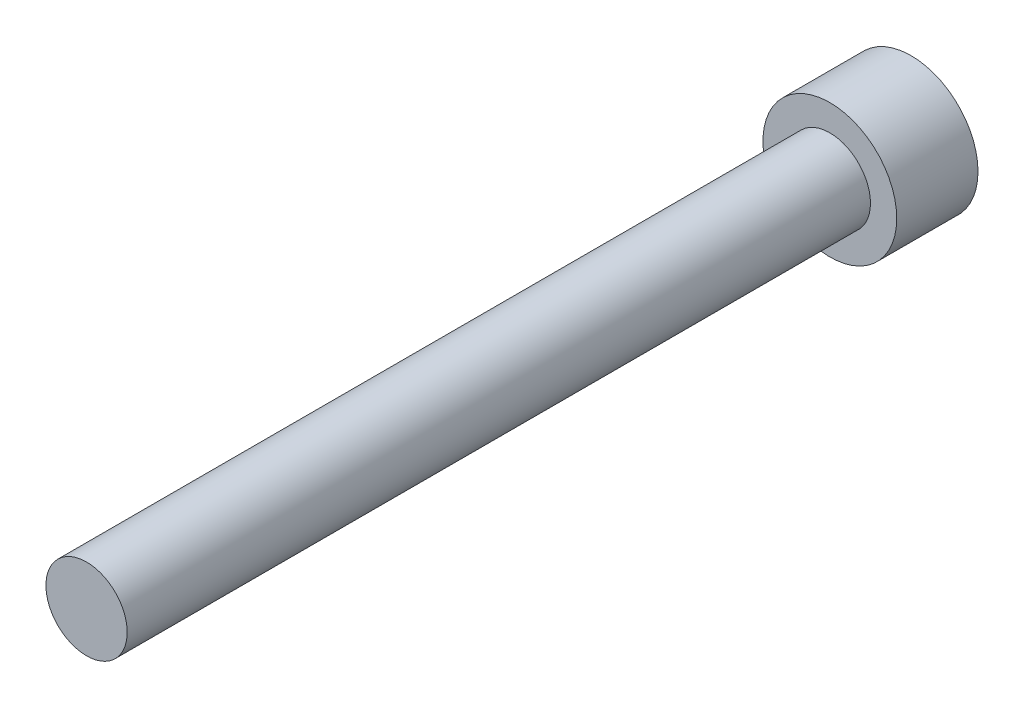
ISO-10303-21;
HEADER;
FILE_DESCRIPTION(('STEP AP214'),'2;1');
FILE_NAME('part.step','',(''),(''),'','','');
FILE_SCHEMA(('AUTOMOTIVE_DESIGN { 1 0 10303 214 1 1 1 1 }'));
ENDSEC;
DATA;
#1=APPLICATION_CONTEXT('core data for automotive mechanical design processes');
#2=APPLICATION_PROTOCOL_DEFINITION('international standard','automotive_design',2000,#1);
#3=PRODUCT_CONTEXT('',#1,'mechanical');
#4=PRODUCT('Part','Part','',(#3));
#5=PRODUCT_RELATED_PRODUCT_CATEGORY('part','',(#4));
#6=PRODUCT_DEFINITION_FORMATION('','',#4);
#7=PRODUCT_DEFINITION_CONTEXT('part definition',#1,'design');
#8=PRODUCT_DEFINITION('design','',#6,#7);
#9=PRODUCT_DEFINITION_SHAPE('','',#8);
#10=(LENGTH_UNIT() NAMED_UNIT(*) SI_UNIT(.MILLI.,.METRE.));
#11=(NAMED_UNIT(*) PLANE_ANGLE_UNIT() SI_UNIT($,.RADIAN.));
#12=(NAMED_UNIT(*) SI_UNIT($,.STERADIAN.) SOLID_ANGLE_UNIT());
#13=UNCERTAINTY_MEASURE_WITH_UNIT(LENGTH_MEASURE(1.E-05),#10,'distance_accuracy_value','');
#14=(GEOMETRIC_REPRESENTATION_CONTEXT(3) GLOBAL_UNCERTAINTY_ASSIGNED_CONTEXT((#13)) GLOBAL_UNIT_ASSIGNED_CONTEXT((#10,
#11,#12)) REPRESENTATION_CONTEXT('',''));
#15=CARTESIAN_POINT('',(0.,0.,0.));
#16=DIRECTION('',(0.,0.,1.));
#17=DIRECTION('',(1.,0.,0.));
#18=AXIS2_PLACEMENT_3D('',#15,#16,#17);
#19=CARTESIAN_POINT('',(0.,0.,38.1));
#20=DIRECTION('',(0.,0.,1.));
#21=DIRECTION('',(1.,0.,0.));
#22=AXIS2_PLACEMENT_3D('',#19,#20,#21);
#23=PLANE('',#22);
#24=CARTESIAN_POINT('',(0.,0.,38.1));
#25=DIRECTION('',(0.,0.,1.));
#26=DIRECTION('',(1.,0.,0.));
#27=AXIS2_PLACEMENT_3D('',#24,#25,#26);
#28=CIRCLE('',#27,2.0828);
#29=CARTESIAN_POINT('',(2.0828,0.,38.1));
#30=VERTEX_POINT('',#29);
#31=EDGE_CURVE('E11',#30,#30,#28,.T.);
#32=ORIENTED_EDGE('',*,*,#31,.T.);
#33=EDGE_LOOP('',(#32));
#34=FACE_BOUND('',#33,.T.);
#35=ADVANCED_FACE('F37',(#34),#23,.T.);
#36=CARTESIAN_POINT('',(0.,0.,38.1));
#37=DIRECTION('',(0.,0.,1.));
#38=DIRECTION('',(1.,0.,0.));
#39=AXIS2_PLACEMENT_3D('',#36,#37,#38);
#40=CYLINDRICAL_SURFACE('',#39,2.0828);
#41=CARTESIAN_POINT('',(0.,0.,0.));
#42=DIRECTION('',(0.,0.,1.));
#43=DIRECTION('',(1.,0.,0.));
#44=AXIS2_PLACEMENT_3D('',#41,#42,#43);
#45=CIRCLE('',#44,2.0828);
#46=CARTESIAN_POINT('',(2.0828,0.,0.));
#47=VERTEX_POINT('',#46);
#48=EDGE_CURVE('E44',#47,#47,#45,.T.);
#49=ORIENTED_EDGE('',*,*,#48,.T.);
#50=EDGE_LOOP('',(#49));
#51=FACE_BOUND('',#50,.T.);
#52=ORIENTED_EDGE('',*,*,#31,.F.);
#53=EDGE_LOOP('',(#52));
#54=FACE_BOUND('',#53,.T.);
#55=ADVANCED_FACE('F151',(#51,#54),#40,.T.);
#56=CARTESIAN_POINT('',(0.,-2.0828,0.));
#57=DIRECTION('',(0.,0.,1.));
#58=DIRECTION('',(1.,0.,0.));
#59=AXIS2_PLACEMENT_3D('',#56,#57,#58);
#60=PLANE('',#59);
#61=CARTESIAN_POINT('',(0.,0.,0.));
#62=DIRECTION('',(0.,0.,1.));
#63=DIRECTION('',(1.,0.,0.));
#64=AXIS2_PLACEMENT_3D('',#61,#62,#63);
#65=CIRCLE('',#64,3.429);
#66=CARTESIAN_POINT('',(3.429,0.,0.));
#67=VERTEX_POINT('',#66);
#68=EDGE_CURVE('E146',#67,#67,#65,.T.);
#69=ORIENTED_EDGE('',*,*,#68,.T.);
#70=EDGE_LOOP('',(#69));
#71=FACE_BOUND('',#70,.T.);
#72=ORIENTED_EDGE('',*,*,#48,.F.);
#73=EDGE_LOOP('',(#72));
#74=FACE_BOUND('',#73,.T.);
#75=ADVANCED_FACE('F154',(#71,#74),#60,.T.);
#76=CARTESIAN_POINT('',(0.,0.,38.1));
#77=DIRECTION('',(0.,0.,1.));
#78=DIRECTION('',(1.,0.,0.));
#79=AXIS2_PLACEMENT_3D('',#76,#77,#78);
#80=CYLINDRICAL_SURFACE('',#79,3.429);
#81=CARTESIAN_POINT('',(0.,0.,-4.1656));
#82=DIRECTION('',(0.,0.,1.));
#83=DIRECTION('',(1.,0.,0.));
#84=AXIS2_PLACEMENT_3D('',#81,#82,#83);
#85=CIRCLE('',#84,3.429);
#86=CARTESIAN_POINT('',(3.429,0.,-4.1656));
#87=VERTEX_POINT('',#86);
#88=EDGE_CURVE('E138',#87,#87,#85,.T.);
#89=ORIENTED_EDGE('',*,*,#88,.T.);
#90=EDGE_LOOP('',(#89));
#91=FACE_BOUND('',#90,.T.);
#92=ORIENTED_EDGE('',*,*,#68,.F.);
#93=EDGE_LOOP('',(#92));
#94=FACE_BOUND('',#93,.T.);
#95=ADVANCED_FACE('F156',(#91,#94),#80,.T.);
#96=CARTESIAN_POINT('',(0.,-3.429,-4.1656));
#97=DIRECTION('',(0.,0.,-1.));
#98=DIRECTION('',(-1.,0.,0.));
#99=AXIS2_PLACEMENT_3D('',#96,#97,#98);
#100=PLANE('',#99);
#101=DIRECTION('',(0.866025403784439,-0.5,0.));
#102=VECTOR('',#101,1.);
#103=CARTESIAN_POINT('',(0.,2.05305755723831,-4.1656));
#104=LINE('',#103,#102);
#105=CARTESIAN_POINT('',(0.,2.05305755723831,-4.1656));
#106=VERTEX_POINT('',#105);
#107=CARTESIAN_POINT('',(1.778,1.02652877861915,-4.1656));
#108=VERTEX_POINT('',#107);
#109=EDGE_CURVE('E51',#106,#108,#104,.T.);
#110=ORIENTED_EDGE('',*,*,#109,.F.);
#111=DIRECTION('',(0.866025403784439,0.5,0.));
#112=VECTOR('',#111,1.);
#113=CARTESIAN_POINT('',(-1.778,1.02652877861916,-4.1656));
#114=LINE('',#113,#112);
#115=CARTESIAN_POINT('',(-1.778,1.02652877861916,-4.1656));
#116=VERTEX_POINT('',#115);
#117=EDGE_CURVE('E134',#116,#106,#114,.T.);
#118=ORIENTED_EDGE('',*,*,#117,.F.);
#119=DIRECTION('',(0.,1.,0.));
#120=VECTOR('',#119,1.);
#121=CARTESIAN_POINT('',(-1.778,-1.02652877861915,-4.1656));
#122=LINE('',#121,#120);
#123=CARTESIAN_POINT('',(-1.778,-1.02652877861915,-4.1656));
#124=VERTEX_POINT('',#123);
#125=EDGE_CURVE('E132',#124,#116,#122,.T.);
#126=ORIENTED_EDGE('',*,*,#125,.F.);
#127=DIRECTION('',(-0.866025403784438,0.5,0.));
#128=VECTOR('',#127,1.);
#129=CARTESIAN_POINT('',(0.,-2.05305755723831,-4.1656));
#130=LINE('',#129,#128);
#131=CARTESIAN_POINT('',(0.,-2.05305755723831,-4.1656));
#132=VERTEX_POINT('',#131);
#133=EDGE_CURVE('E99',#132,#124,#130,.T.);
#134=ORIENTED_EDGE('',*,*,#133,.F.);
#135=DIRECTION('',(-0.866025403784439,-0.5,0.));
#136=VECTOR('',#135,1.);
#137=CARTESIAN_POINT('',(1.778,-1.02652877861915,-4.1656));
#138=LINE('',#137,#136);
#139=CARTESIAN_POINT('',(1.778,-1.02652877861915,-4.1656));
#140=VERTEX_POINT('',#139);
#141=EDGE_CURVE('E128',#140,#132,#138,.T.);
#142=ORIENTED_EDGE('',*,*,#141,.F.);
#143=DIRECTION('',(0.,-1.,0.));
#144=VECTOR('',#143,1.);
#145=CARTESIAN_POINT('',(1.778,1.02652877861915,-4.1656));
#146=LINE('',#145,#144);
#147=EDGE_CURVE('E125',#108,#140,#146,.T.);
#148=ORIENTED_EDGE('',*,*,#147,.F.);
#149=EDGE_LOOP('',(#110,#118,#126,#134,#142,#148));
#150=FACE_BOUND('',#149,.T.);
#151=ORIENTED_EDGE('',*,*,#88,.F.);
#152=EDGE_LOOP('',(#151));
#153=FACE_BOUND('',#152,.T.);
#154=ADVANCED_FACE('F163',(#150,#153),#100,.T.);
#155=CARTESIAN_POINT('',(0.,2.05305755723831,-1.3716));
#156=DIRECTION('',(0.5,0.866025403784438,0.));
#157=DIRECTION('',(-0.866025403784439,0.5,0.));
#158=AXIS2_PLACEMENT_3D('',#155,#156,#157);
#159=PLANE('',#158);
#160=ORIENTED_EDGE('',*,*,#109,.T.);
#161=DIRECTION('',(0.,0.,-1.));
#162=VECTOR('',#161,1.);
#163=CARTESIAN_POINT('',(1.778,1.02652877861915,-1.3716));
#164=LINE('',#163,#162);
#165=CARTESIAN_POINT('',(1.778,1.02652877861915,-1.3716));
#166=VERTEX_POINT('',#165);
#167=EDGE_CURVE('E81',#166,#108,#164,.T.);
#168=ORIENTED_EDGE('',*,*,#167,.F.);
#169=DIRECTION('',(0.866025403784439,-0.5,0.));
#170=VECTOR('',#169,1.);
#171=CARTESIAN_POINT('',(0.,2.05305755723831,-1.3716));
#172=LINE('',#171,#170);
#173=CARTESIAN_POINT('',(0.,2.05305755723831,-1.3716));
#174=VERTEX_POINT('',#173);
#175=EDGE_CURVE('E136',#174,#166,#172,.T.);
#176=ORIENTED_EDGE('',*,*,#175,.F.);
#177=DIRECTION('',(0.,0.,-1.));
#178=VECTOR('',#177,1.);
#179=CARTESIAN_POINT('',(0.,2.05305755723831,-1.3716));
#180=LINE('',#179,#178);
#181=EDGE_CURVE('E59',#174,#106,#180,.T.);
#182=ORIENTED_EDGE('',*,*,#181,.T.);
#183=EDGE_LOOP('',(#160,#168,#176,#182));
#184=FACE_BOUND('',#183,.T.);
#185=ADVANCED_FACE('F197',(#184),#159,.F.);
#186=CARTESIAN_POINT('',(-1.778,1.02652877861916,-1.3716));
#187=DIRECTION('',(-0.5,0.866025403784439,0.));
#188=DIRECTION('',(-0.866025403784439,-0.5,0.));
#189=AXIS2_PLACEMENT_3D('',#186,#187,#188);
#190=PLANE('',#189);
#191=ORIENTED_EDGE('',*,*,#117,.T.);
#192=ORIENTED_EDGE('',*,*,#181,.F.);
#193=DIRECTION('',(0.866025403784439,0.5,0.));
#194=VECTOR('',#193,1.);
#195=CARTESIAN_POINT('',(-1.778,1.02652877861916,-1.3716));
#196=LINE('',#195,#194);
#197=CARTESIAN_POINT('',(-1.778,1.02652877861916,-1.3716));
#198=VERTEX_POINT('',#197);
#199=EDGE_CURVE('E111',#198,#174,#196,.T.);
#200=ORIENTED_EDGE('',*,*,#199,.F.);
#201=DIRECTION('',(0.,0.,-1.));
#202=VECTOR('',#201,1.);
#203=CARTESIAN_POINT('',(-1.778,1.02652877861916,-1.3716));
#204=LINE('',#203,#202);
#205=EDGE_CURVE('E103',#198,#116,#204,.T.);
#206=ORIENTED_EDGE('',*,*,#205,.T.);
#207=EDGE_LOOP('',(#191,#192,#200,#206));
#208=FACE_BOUND('',#207,.T.);
#209=ADVANCED_FACE('F208',(#208),#190,.F.);
#210=CARTESIAN_POINT('',(-1.778,-1.02652877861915,-1.3716));
#211=DIRECTION('',(-1.,0.,0.));
#212=DIRECTION('',(0.,0.,1.));
#213=AXIS2_PLACEMENT_3D('',#210,#211,#212);
#214=PLANE('',#213);
#215=ORIENTED_EDGE('',*,*,#125,.T.);
#216=ORIENTED_EDGE('',*,*,#205,.F.);
#217=DIRECTION('',(0.,1.,0.));
#218=VECTOR('',#217,1.);
#219=CARTESIAN_POINT('',(-1.778,-1.02652877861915,-1.3716));
#220=LINE('',#219,#218);
#221=CARTESIAN_POINT('',(-1.778,-1.02652877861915,-1.3716));
#222=VERTEX_POINT('',#221);
#223=EDGE_CURVE('E107',#222,#198,#220,.T.);
#224=ORIENTED_EDGE('',*,*,#223,.F.);
#225=DIRECTION('',(0.,0.,-1.));
#226=VECTOR('',#225,1.);
#227=CARTESIAN_POINT('',(-1.778,-1.02652877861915,-1.3716));
#228=LINE('',#227,#226);
#229=EDGE_CURVE('E92',#222,#124,#228,.T.);
#230=ORIENTED_EDGE('',*,*,#229,.T.);
#231=EDGE_LOOP('',(#215,#216,#224,#230));
#232=FACE_BOUND('',#231,.T.);
#233=ADVANCED_FACE('F108',(#232),#214,.F.);
#234=CARTESIAN_POINT('',(0.,-2.05305755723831,-1.3716));
#235=DIRECTION('',(-0.5,-0.866025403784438,0.));
#236=DIRECTION('',(0.866025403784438,-0.5,0.));
#237=AXIS2_PLACEMENT_3D('',#234,#235,#236);
#238=PLANE('',#237);
#239=ORIENTED_EDGE('',*,*,#133,.T.);
#240=ORIENTED_EDGE('',*,*,#229,.F.);
#241=DIRECTION('',(-0.866025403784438,0.5,0.));
#242=VECTOR('',#241,1.);
#243=CARTESIAN_POINT('',(0.,-2.05305755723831,-1.3716));
#244=LINE('',#243,#242);
#245=CARTESIAN_POINT('',(0.,-2.05305755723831,-1.3716));
#246=VERTEX_POINT('',#245);
#247=EDGE_CURVE('E96',#246,#222,#244,.T.);
#248=ORIENTED_EDGE('',*,*,#247,.F.);
#249=DIRECTION('',(0.,0.,-1.));
#250=VECTOR('',#249,1.);
#251=CARTESIAN_POINT('',(0.,-2.05305755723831,-1.3716));
#252=LINE('',#251,#250);
#253=EDGE_CURVE('E104',#246,#132,#252,.T.);
#254=ORIENTED_EDGE('',*,*,#253,.T.);
#255=EDGE_LOOP('',(#239,#240,#248,#254));
#256=FACE_BOUND('',#255,.T.);
#257=ADVANCED_FACE('F94',(#256),#238,.F.);
#258=CARTESIAN_POINT('',(1.778,-1.02652877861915,-1.3716));
#259=DIRECTION('',(0.5,-0.866025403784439,0.));
#260=DIRECTION('',(0.866025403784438,0.5,0.));
#261=AXIS2_PLACEMENT_3D('',#258,#259,#260);
#262=PLANE('',#261);
#263=ORIENTED_EDGE('',*,*,#141,.T.);
#264=ORIENTED_EDGE('',*,*,#253,.F.);
#265=DIRECTION('',(-0.866025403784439,-0.5,0.));
#266=VECTOR('',#265,1.);
#267=CARTESIAN_POINT('',(1.778,-1.02652877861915,-1.3716));
#268=LINE('',#267,#266);
#269=CARTESIAN_POINT('',(1.778,-1.02652877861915,-1.3716));
#270=VERTEX_POINT('',#269);
#271=EDGE_CURVE('E117',#270,#246,#268,.T.);
#272=ORIENTED_EDGE('',*,*,#271,.F.);
#273=DIRECTION('',(0.,0.,-1.));
#274=VECTOR('',#273,1.);
#275=CARTESIAN_POINT('',(1.778,-1.02652877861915,-1.3716));
#276=LINE('',#275,#274);
#277=EDGE_CURVE('E141',#270,#140,#276,.T.);
#278=ORIENTED_EDGE('',*,*,#277,.T.);
#279=EDGE_LOOP('',(#263,#264,#272,#278));
#280=FACE_BOUND('',#279,.T.);
#281=ADVANCED_FACE('F236',(#280),#262,.F.);
#282=CARTESIAN_POINT('',(1.778,1.02652877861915,-1.3716));
#283=DIRECTION('',(1.,0.,0.));
#284=DIRECTION('',(0.,0.,-1.));
#285=AXIS2_PLACEMENT_3D('',#282,#283,#284);
#286=PLANE('',#285);
#287=ORIENTED_EDGE('',*,*,#147,.T.);
#288=ORIENTED_EDGE('',*,*,#277,.F.);
#289=DIRECTION('',(0.,-1.,0.));
#290=VECTOR('',#289,1.);
#291=CARTESIAN_POINT('',(1.778,1.02652877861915,-1.3716));
#292=LINE('',#291,#290);
#293=EDGE_CURVE('E119',#166,#270,#292,.T.);
#294=ORIENTED_EDGE('',*,*,#293,.F.);
#295=ORIENTED_EDGE('',*,*,#167,.T.);
#296=EDGE_LOOP('',(#287,#288,#294,#295));
#297=FACE_BOUND('',#296,.T.);
#298=ADVANCED_FACE('F246',(#297),#286,.F.);
#299=CARTESIAN_POINT('',(3.556,0.,-1.3716));
#300=DIRECTION('',(0.,0.,-1.));
#301=DIRECTION('',(-1.,0.,0.));
#302=AXIS2_PLACEMENT_3D('',#299,#300,#301);
#303=PLANE('',#302);
#304=ORIENTED_EDGE('',*,*,#175,.T.);
#305=ORIENTED_EDGE('',*,*,#293,.T.);
#306=ORIENTED_EDGE('',*,*,#271,.T.);
#307=ORIENTED_EDGE('',*,*,#247,.T.);
#308=ORIENTED_EDGE('',*,*,#223,.T.);
#309=ORIENTED_EDGE('',*,*,#199,.T.);
#310=EDGE_LOOP('',(#304,#305,#306,#307,#308,#309));
#311=FACE_BOUND('',#310,.T.);
#312=ADVANCED_FACE('F114',(#311),#303,.T.);
#313=CLOSED_SHELL('',(#35,#55,#75,#95,#154,#185,#209,#233,#257,#281,#298,#312));
#314=MANIFOLD_SOLID_BREP('B2',#313);
#315=ADVANCED_BREP_SHAPE_REPRESENTATION('',(#18,#314),#14);
#316=SHAPE_DEFINITION_REPRESENTATION(#9,#315);
ENDSEC;
END-ISO-10303-21;
